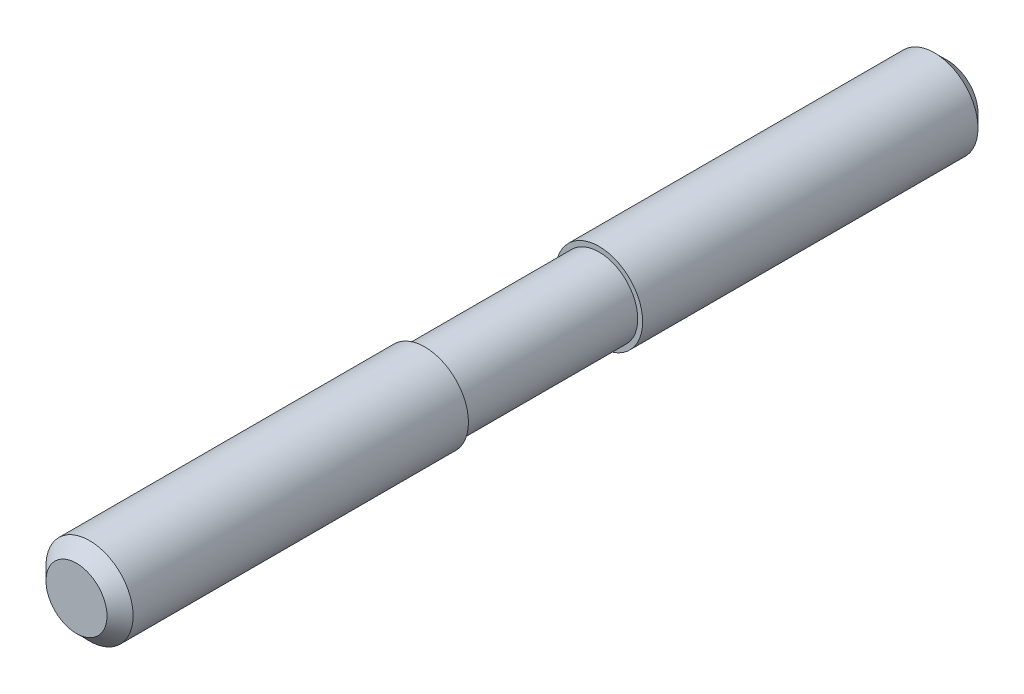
ISO-10303-21;
HEADER;
FILE_DESCRIPTION(('STEP AP214'),'2;1');
FILE_NAME('part.step','',(''),(''),'','','');
FILE_SCHEMA(('AUTOMOTIVE_DESIGN { 1 0 10303 214 1 1 1 1 }'));
ENDSEC;
DATA;
#1=APPLICATION_CONTEXT('core data for automotive mechanical design processes');
#2=APPLICATION_PROTOCOL_DEFINITION('international standard','automotive_design',2000,#1);
#3=PRODUCT_CONTEXT('',#1,'mechanical');
#4=PRODUCT('Part','Part','',(#3));
#5=PRODUCT_RELATED_PRODUCT_CATEGORY('part','',(#4));
#6=PRODUCT_DEFINITION_FORMATION('','',#4);
#7=PRODUCT_DEFINITION_CONTEXT('part definition',#1,'design');
#8=PRODUCT_DEFINITION('design','',#6,#7);
#9=PRODUCT_DEFINITION_SHAPE('','',#8);
#10=(LENGTH_UNIT() NAMED_UNIT(*) SI_UNIT(.MILLI.,.METRE.));
#11=(NAMED_UNIT(*) PLANE_ANGLE_UNIT() SI_UNIT($,.RADIAN.));
#12=(NAMED_UNIT(*) SI_UNIT($,.STERADIAN.) SOLID_ANGLE_UNIT());
#13=UNCERTAINTY_MEASURE_WITH_UNIT(LENGTH_MEASURE(1.E-05),#10,'distance_accuracy_value','');
#14=(GEOMETRIC_REPRESENTATION_CONTEXT(3) GLOBAL_UNCERTAINTY_ASSIGNED_CONTEXT((#13)) GLOBAL_UNIT_ASSIGNED_CONTEXT((#10,
#11,#12)) REPRESENTATION_CONTEXT('',''));
#15=CARTESIAN_POINT('',(0.,0.,0.));
#16=DIRECTION('',(0.,0.,1.));
#17=DIRECTION('',(1.,0.,0.));
#18=AXIS2_PLACEMENT_3D('',#15,#16,#17);
#19=CARTESIAN_POINT('',(0.,0.,0.));
#20=DIRECTION('',(0.,0.,1.));
#21=DIRECTION('',(1.,0.,0.));
#22=AXIS2_PLACEMENT_3D('',#19,#20,#21);
#23=PLANE('',#22);
#24=CARTESIAN_POINT('',(0.,0.,0.));
#25=DIRECTION('',(0.,0.,1.));
#26=DIRECTION('',(1.,0.,0.));
#27=AXIS2_PLACEMENT_3D('',#24,#25,#26);
#28=CIRCLE('',#27,2.8);
#29=CARTESIAN_POINT('',(2.8,0.,0.));
#30=VERTEX_POINT('',#29);
#31=EDGE_CURVE('E8',#30,#30,#28,.T.);
#32=ORIENTED_EDGE('',*,*,#31,.F.);
#33=EDGE_LOOP('',(#32));
#34=FACE_BOUND('',#33,.T.);
#35=ADVANCED_FACE('F12',(#34),#23,.F.);
#36=CARTESIAN_POINT('',(0.,0.,1.2));
#37=DIRECTION('',(0.,0.,1.));
#38=DIRECTION('',(1.,0.,0.));
#39=AXIS2_PLACEMENT_3D('',#36,#37,#38);
#40=CONICAL_SURFACE('',#39,4.,0.785398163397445);
#41=ORIENTED_EDGE('',*,*,#31,.T.);
#42=EDGE_LOOP('',(#41));
#43=FACE_BOUND('',#42,.T.);
#44=CARTESIAN_POINT('',(0.,0.,1.2));
#45=DIRECTION('',(0.,0.,1.));
#46=DIRECTION('',(1.,0.,0.));
#47=AXIS2_PLACEMENT_3D('',#44,#45,#46);
#48=CIRCLE('',#47,4.);
#49=CARTESIAN_POINT('',(4.,0.,1.2));
#50=VERTEX_POINT('',#49);
#51=EDGE_CURVE('E18',#50,#50,#48,.T.);
#52=ORIENTED_EDGE('',*,*,#51,.F.);
#53=EDGE_LOOP('',(#52));
#54=FACE_BOUND('',#53,.T.);
#55=ADVANCED_FACE('F62',(#43,#54),#40,.T.);
#56=CARTESIAN_POINT('',(0.,0.,70.));
#57=DIRECTION('',(0.,0.,1.));
#58=DIRECTION('',(1.,0.,0.));
#59=AXIS2_PLACEMENT_3D('',#56,#57,#58);
#60=CYLINDRICAL_SURFACE('',#59,4.);
#61=CARTESIAN_POINT('',(0.,0.,32.));
#62=DIRECTION('',(0.,0.,1.));
#63=DIRECTION('',(1.,0.,0.));
#64=AXIS2_PLACEMENT_3D('',#61,#62,#63);
#65=CIRCLE('',#64,4.);
#66=CARTESIAN_POINT('',(4.,0.,32.));
#67=VERTEX_POINT('',#66);
#68=EDGE_CURVE('E22',#67,#67,#65,.T.);
#69=ORIENTED_EDGE('',*,*,#68,.F.);
#70=EDGE_LOOP('',(#69));
#71=FACE_BOUND('',#70,.T.);
#72=ORIENTED_EDGE('',*,*,#51,.T.);
#73=EDGE_LOOP('',(#72));
#74=FACE_BOUND('',#73,.T.);
#75=ADVANCED_FACE('F68',(#71,#74),#60,.T.);
#76=CARTESIAN_POINT('',(4.,0.,32.));
#77=DIRECTION('',(0.,0.,-1.));
#78=DIRECTION('',(-1.,0.,0.));
#79=AXIS2_PLACEMENT_3D('',#76,#77,#78);
#80=PLANE('',#79);
#81=CARTESIAN_POINT('',(0.,0.,32.));
#82=DIRECTION('',(0.,0.,1.));
#83=DIRECTION('',(1.,0.,0.));
#84=AXIS2_PLACEMENT_3D('',#81,#82,#83);
#85=CIRCLE('',#84,3.55);
#86=CARTESIAN_POINT('',(3.55,0.,32.));
#87=VERTEX_POINT('',#86);
#88=EDGE_CURVE('E26',#87,#87,#85,.T.);
#89=ORIENTED_EDGE('',*,*,#88,.F.);
#90=EDGE_LOOP('',(#89));
#91=FACE_BOUND('',#90,.T.);
#92=ORIENTED_EDGE('',*,*,#68,.T.);
#93=EDGE_LOOP('',(#92));
#94=FACE_BOUND('',#93,.T.);
#95=ADVANCED_FACE('F73',(#91,#94),#80,.F.);
#96=CARTESIAN_POINT('',(0.,0.,70.));
#97=DIRECTION('',(0.,0.,1.));
#98=DIRECTION('',(1.,0.,0.));
#99=AXIS2_PLACEMENT_3D('',#96,#97,#98);
#100=CYLINDRICAL_SURFACE('',#99,3.55);
#101=CARTESIAN_POINT('',(0.,0.,48.));
#102=DIRECTION('',(0.,0.,1.));
#103=DIRECTION('',(1.,0.,0.));
#104=AXIS2_PLACEMENT_3D('',#101,#102,#103);
#105=CIRCLE('',#104,3.55);
#106=CARTESIAN_POINT('',(3.55,0.,48.));
#107=VERTEX_POINT('',#106);
#108=EDGE_CURVE('E31',#107,#107,#105,.T.);
#109=ORIENTED_EDGE('',*,*,#108,.F.);
#110=EDGE_LOOP('',(#109));
#111=FACE_BOUND('',#110,.T.);
#112=ORIENTED_EDGE('',*,*,#88,.T.);
#113=EDGE_LOOP('',(#112));
#114=FACE_BOUND('',#113,.T.);
#115=ADVANCED_FACE('F80',(#111,#114),#100,.T.);
#116=CARTESIAN_POINT('',(3.55,0.,48.));
#117=DIRECTION('',(0.,0.,1.));
#118=DIRECTION('',(1.,0.,0.));
#119=AXIS2_PLACEMENT_3D('',#116,#117,#118);
#120=PLANE('',#119);
#121=CARTESIAN_POINT('',(0.,0.,48.));
#122=DIRECTION('',(0.,0.,1.));
#123=DIRECTION('',(1.,0.,0.));
#124=AXIS2_PLACEMENT_3D('',#121,#122,#123);
#125=CIRCLE('',#124,4.);
#126=CARTESIAN_POINT('',(4.,0.,48.));
#127=VERTEX_POINT('',#126);
#128=EDGE_CURVE('E34',#127,#127,#125,.T.);
#129=ORIENTED_EDGE('',*,*,#128,.F.);
#130=EDGE_LOOP('',(#129));
#131=FACE_BOUND('',#130,.T.);
#132=ORIENTED_EDGE('',*,*,#108,.T.);
#133=EDGE_LOOP('',(#132));
#134=FACE_BOUND('',#133,.T.);
#135=ADVANCED_FACE('F58',(#131,#134),#120,.F.);
#136=CARTESIAN_POINT('',(0.,0.,70.));
#137=DIRECTION('',(0.,0.,1.));
#138=DIRECTION('',(1.,0.,0.));
#139=AXIS2_PLACEMENT_3D('',#136,#137,#138);
#140=CYLINDRICAL_SURFACE('',#139,4.);
#141=CARTESIAN_POINT('',(0.,0.,78.8));
#142=DIRECTION('',(0.,0.,1.));
#143=DIRECTION('',(1.,0.,0.));
#144=AXIS2_PLACEMENT_3D('',#141,#142,#143);
#145=CIRCLE('',#144,4.);
#146=CARTESIAN_POINT('',(4.,0.,78.8));
#147=VERTEX_POINT('',#146);
#148=EDGE_CURVE('E37',#147,#147,#145,.T.);
#149=ORIENTED_EDGE('',*,*,#148,.F.);
#150=EDGE_LOOP('',(#149));
#151=FACE_BOUND('',#150,.T.);
#152=ORIENTED_EDGE('',*,*,#128,.T.);
#153=EDGE_LOOP('',(#152));
#154=FACE_BOUND('',#153,.T.);
#155=ADVANCED_FACE('F48',(#151,#154),#140,.T.);
#156=CARTESIAN_POINT('',(0.,0.,80.));
#157=DIRECTION('',(0.,0.,-1.));
#158=DIRECTION('',(-1.,0.,0.));
#159=AXIS2_PLACEMENT_3D('',#156,#157,#158);
#160=CONICAL_SURFACE('',#159,2.8,0.785398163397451);
#161=ORIENTED_EDGE('',*,*,#148,.T.);
#162=EDGE_LOOP('',(#161));
#163=FACE_BOUND('',#162,.T.);
#164=CARTESIAN_POINT('',(0.,0.,80.));
#165=DIRECTION('',(0.,0.,1.));
#166=DIRECTION('',(1.,0.,0.));
#167=AXIS2_PLACEMENT_3D('',#164,#165,#166);
#168=CIRCLE('',#167,2.8);
#169=CARTESIAN_POINT('',(2.8,0.,80.));
#170=VERTEX_POINT('',#169);
#171=EDGE_CURVE('E40',#170,#170,#168,.T.);
#172=ORIENTED_EDGE('',*,*,#171,.F.);
#173=EDGE_LOOP('',(#172));
#174=FACE_BOUND('',#173,.T.);
#175=ADVANCED_FACE('F46',(#163,#174),#160,.T.);
#176=CARTESIAN_POINT('',(2.8,0.,80.));
#177=DIRECTION('',(0.,0.,-1.));
#178=DIRECTION('',(-1.,0.,0.));
#179=AXIS2_PLACEMENT_3D('',#176,#177,#178);
#180=PLANE('',#179);
#181=ORIENTED_EDGE('',*,*,#171,.T.);
#182=EDGE_LOOP('',(#181));
#183=FACE_BOUND('',#182,.T.);
#184=ADVANCED_FACE('F44',(#183),#180,.F.);
#185=CLOSED_SHELL('',(#35,#55,#75,#95,#115,#135,#155,#175,#184));
#186=MANIFOLD_SOLID_BREP('B1',#185);
#187=ADVANCED_BREP_SHAPE_REPRESENTATION('',(#18,#186),#14);
#188=SHAPE_DEFINITION_REPRESENTATION(#9,#187);
ENDSEC;
END-ISO-10303-21;
